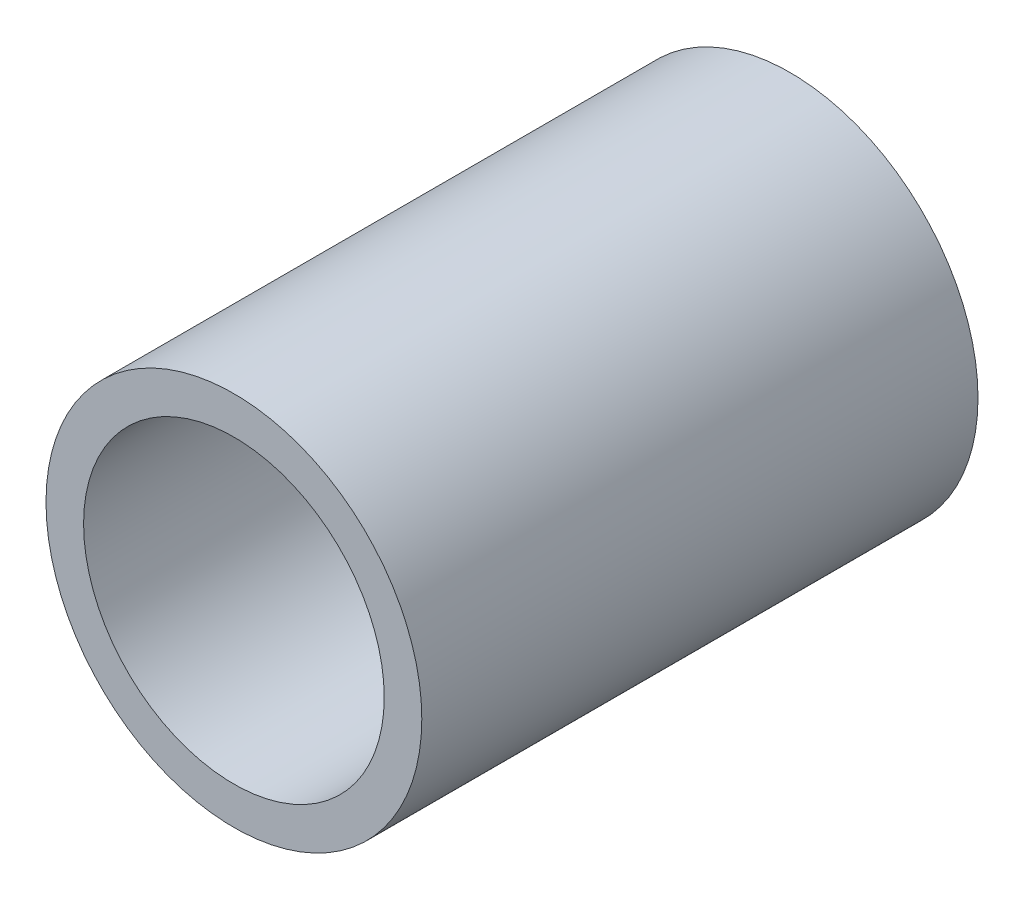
ISO-10303-21;
HEADER;
FILE_DESCRIPTION(('STEP AP214'),'2;1');
FILE_NAME('part.step','',(''),(''),'','','');
FILE_SCHEMA(('AUTOMOTIVE_DESIGN { 1 0 10303 214 1 1 1 1 }'));
ENDSEC;
DATA;
#1=APPLICATION_CONTEXT('core data for automotive mechanical design processes');
#2=APPLICATION_PROTOCOL_DEFINITION('international standard','automotive_design',2000,#1);
#3=PRODUCT_CONTEXT('',#1,'mechanical');
#4=PRODUCT('Part','Part','',(#3));
#5=PRODUCT_RELATED_PRODUCT_CATEGORY('part','',(#4));
#6=PRODUCT_DEFINITION_FORMATION('','',#4);
#7=PRODUCT_DEFINITION_CONTEXT('part definition',#1,'design');
#8=PRODUCT_DEFINITION('design','',#6,#7);
#9=PRODUCT_DEFINITION_SHAPE('','',#8);
#10=(LENGTH_UNIT() NAMED_UNIT(*) SI_UNIT(.MILLI.,.METRE.));
#11=(NAMED_UNIT(*) PLANE_ANGLE_UNIT() SI_UNIT($,.RADIAN.));
#12=(NAMED_UNIT(*) SI_UNIT($,.STERADIAN.) SOLID_ANGLE_UNIT());
#13=UNCERTAINTY_MEASURE_WITH_UNIT(LENGTH_MEASURE(1.E-05),#10,'distance_accuracy_value','');
#14=(GEOMETRIC_REPRESENTATION_CONTEXT(3) GLOBAL_UNCERTAINTY_ASSIGNED_CONTEXT((#13)) GLOBAL_UNIT_ASSIGNED_CONTEXT((#10,
#11,#12)) REPRESENTATION_CONTEXT('',''));
#15=CARTESIAN_POINT('',(0.,0.,0.));
#16=DIRECTION('',(0.,0.,1.));
#17=DIRECTION('',(1.,0.,0.));
#18=AXIS2_PLACEMENT_3D('',#15,#16,#17);
#19=CARTESIAN_POINT('',(0.,0.,37.));
#20=DIRECTION('',(0.,0.,1.));
#21=DIRECTION('',(1.,0.,0.));
#22=AXIS2_PLACEMENT_3D('',#19,#20,#21);
#23=PLANE('',#22);
#24=CARTESIAN_POINT('',(0.,0.,37.));
#25=DIRECTION('',(0.,0.,1.));
#26=DIRECTION('',(1.,0.,0.));
#27=AXIS2_PLACEMENT_3D('',#24,#25,#26);
#28=CIRCLE('',#27,12.5);
#29=CARTESIAN_POINT('',(12.5,0.,37.));
#30=VERTEX_POINT('',#29);
#31=EDGE_CURVE('E10',#30,#30,#28,.T.);
#32=ORIENTED_EDGE('',*,*,#31,.T.);
#33=EDGE_LOOP('',(#32));
#34=FACE_BOUND('',#33,.T.);
#35=CARTESIAN_POINT('',(0.,0.,37.));
#36=DIRECTION('',(0.,0.,1.));
#37=DIRECTION('',(1.,0.,0.));
#38=AXIS2_PLACEMENT_3D('',#35,#36,#37);
#39=CIRCLE('',#38,10.);
#40=CARTESIAN_POINT('',(10.,0.,37.));
#41=VERTEX_POINT('',#40);
#42=EDGE_CURVE('E43',#41,#41,#39,.T.);
#43=ORIENTED_EDGE('',*,*,#42,.F.);
#44=EDGE_LOOP('',(#43));
#45=FACE_BOUND('',#44,.T.);
#46=ADVANCED_FACE('F32',(#34,#45),#23,.T.);
#47=CARTESIAN_POINT('',(0.,0.,0.));
#48=DIRECTION('',(0.,0.,1.));
#49=DIRECTION('',(1.,0.,0.));
#50=AXIS2_PLACEMENT_3D('',#47,#48,#49);
#51=PLANE('',#50);
#52=CARTESIAN_POINT('',(0.,0.,0.));
#53=DIRECTION('',(0.,0.,1.));
#54=DIRECTION('',(1.,0.,0.));
#55=AXIS2_PLACEMENT_3D('',#52,#53,#54);
#56=CIRCLE('',#55,12.5);
#57=CARTESIAN_POINT('',(12.5,0.,0.));
#58=VERTEX_POINT('',#57);
#59=EDGE_CURVE('E39',#58,#58,#56,.T.);
#60=ORIENTED_EDGE('',*,*,#59,.F.);
#61=EDGE_LOOP('',(#60));
#62=FACE_BOUND('',#61,.T.);
#63=CARTESIAN_POINT('',(0.,0.,0.));
#64=DIRECTION('',(0.,0.,1.));
#65=DIRECTION('',(1.,0.,0.));
#66=AXIS2_PLACEMENT_3D('',#63,#64,#65);
#67=CIRCLE('',#66,10.);
#68=CARTESIAN_POINT('',(10.,0.,0.));
#69=VERTEX_POINT('',#68);
#70=EDGE_CURVE('E47',#69,#69,#67,.T.);
#71=ORIENTED_EDGE('',*,*,#70,.T.);
#72=EDGE_LOOP('',(#71));
#73=FACE_BOUND('',#72,.T.);
#74=ADVANCED_FACE('F53',(#62,#73),#51,.F.);
#75=CARTESIAN_POINT('',(0.,0.,37.));
#76=DIRECTION('',(0.,0.,-1.));
#77=DIRECTION('',(-1.,0.,0.));
#78=AXIS2_PLACEMENT_3D('',#75,#76,#77);
#79=CYLINDRICAL_SURFACE('',#78,12.5);
#80=ORIENTED_EDGE('',*,*,#31,.F.);
#81=EDGE_LOOP('',(#80));
#82=FACE_BOUND('',#81,.T.);
#83=ORIENTED_EDGE('',*,*,#59,.T.);
#84=EDGE_LOOP('',(#83));
#85=FACE_BOUND('',#84,.T.);
#86=ADVANCED_FACE('F34',(#82,#85),#79,.T.);
#87=CARTESIAN_POINT('',(0.,0.,37.));
#88=DIRECTION('',(0.,0.,-1.));
#89=DIRECTION('',(-1.,0.,0.));
#90=AXIS2_PLACEMENT_3D('',#87,#88,#89);
#91=CYLINDRICAL_SURFACE('',#90,10.);
#92=ORIENTED_EDGE('',*,*,#42,.T.);
#93=EDGE_LOOP('',(#92));
#94=FACE_BOUND('',#93,.T.);
#95=ORIENTED_EDGE('',*,*,#70,.F.);
#96=EDGE_LOOP('',(#95));
#97=FACE_BOUND('',#96,.T.);
#98=ADVANCED_FACE('F55',(#94,#97),#91,.F.);
#99=CLOSED_SHELL('',(#46,#74,#86,#98));
#100=MANIFOLD_SOLID_BREP('B2',#99);
#101=ADVANCED_BREP_SHAPE_REPRESENTATION('',(#18,#100),#14);
#102=SHAPE_DEFINITION_REPRESENTATION(#9,#101);
ENDSEC;
END-ISO-10303-21;
